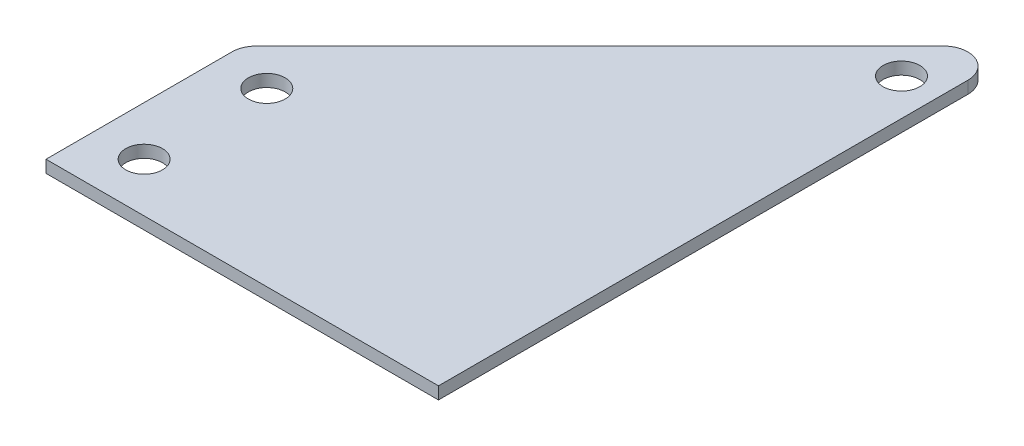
ISO-10303-21;
HEADER;
FILE_DESCRIPTION(('STEP AP214'),'2;1');
FILE_NAME('part.step','',(''),(''),'','','');
FILE_SCHEMA(('AUTOMOTIVE_DESIGN { 1 0 10303 214 1 1 1 1 }'));
ENDSEC;
DATA;
#1=APPLICATION_CONTEXT('core data for automotive mechanical design processes');
#2=APPLICATION_PROTOCOL_DEFINITION('international standard','automotive_design',2000,#1);
#3=PRODUCT_CONTEXT('',#1,'mechanical');
#4=PRODUCT('Part','Part','',(#3));
#5=PRODUCT_RELATED_PRODUCT_CATEGORY('part','',(#4));
#6=PRODUCT_DEFINITION_FORMATION('','',#4);
#7=PRODUCT_DEFINITION_CONTEXT('part definition',#1,'design');
#8=PRODUCT_DEFINITION('design','',#6,#7);
#9=PRODUCT_DEFINITION_SHAPE('','',#8);
#10=(LENGTH_UNIT() NAMED_UNIT(*) SI_UNIT(.MILLI.,.METRE.));
#11=(NAMED_UNIT(*) PLANE_ANGLE_UNIT() SI_UNIT($,.RADIAN.));
#12=(NAMED_UNIT(*) SI_UNIT($,.STERADIAN.) SOLID_ANGLE_UNIT());
#13=UNCERTAINTY_MEASURE_WITH_UNIT(LENGTH_MEASURE(1.E-05),#10,'distance_accuracy_value','');
#14=(GEOMETRIC_REPRESENTATION_CONTEXT(3) GLOBAL_UNCERTAINTY_ASSIGNED_CONTEXT((#13)) GLOBAL_UNIT_ASSIGNED_CONTEXT((#10,
#11,#12)) REPRESENTATION_CONTEXT('',''));
#15=CARTESIAN_POINT('',(0.,0.,0.));
#16=DIRECTION('',(0.,0.,1.));
#17=DIRECTION('',(1.,0.,0.));
#18=AXIS2_PLACEMENT_3D('',#15,#16,#17);
#19=CARTESIAN_POINT('',(-190.5,6.35,-96.266));
#20=DIRECTION('',(0.,1.,0.));
#21=DIRECTION('',(0.,0.,1.));
#22=AXIS2_PLACEMENT_3D('',#19,#20,#21);
#23=PLANE('',#22);
#24=CARTESIAN_POINT('',(-177.8,6.35,-88.9));
#25=DIRECTION('',(0.,1.,0.));
#26=DIRECTION('',(0.,0.,1.));
#27=AXIS2_PLACEMENT_3D('',#24,#25,#26);
#28=CIRCLE('',#27,9.525);
#29=CARTESIAN_POINT('',(-177.8,6.35,-79.375));
#30=VERTEX_POINT('',#29);
#31=EDGE_CURVE('E183',#30,#30,#28,.T.);
#32=ORIENTED_EDGE('',*,*,#31,.F.);
#33=EDGE_LOOP('',(#32));
#34=FACE_BOUND('',#33,.T.);
#35=CARTESIAN_POINT('',(-190.5,6.35,-96.266));
#36=DIRECTION('',(0.,1.,0.));
#37=DIRECTION('',(0.,0.,1.));
#38=AXIS2_PLACEMENT_3D('',#35,#36,#37);
#39=CIRCLE('',#38,12.7);
#40=CARTESIAN_POINT('',(-199.480256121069,6.35,-105.246256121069));
#41=VERTEX_POINT('',#40);
#42=CARTESIAN_POINT('',(-203.2,6.35,-96.266));
#43=VERTEX_POINT('',#42);
#44=EDGE_CURVE('E128',#41,#43,#39,.T.);
#45=ORIENTED_EDGE('',*,*,#44,.T.);
#46=DIRECTION('',(0.,0.,1.));
#47=VECTOR('',#46,1.);
#48=CARTESIAN_POINT('',(-203.2,6.35,-96.266));
#49=LINE('',#48,#47);
#50=CARTESIAN_POINT('',(-203.2,6.35,0.));
#51=VERTEX_POINT('',#50);
#52=EDGE_CURVE('E86',#43,#51,#49,.T.);
#53=ORIENTED_EDGE('',*,*,#52,.T.);
#54=DIRECTION('',(1.,0.,0.));
#55=VECTOR('',#54,1.);
#56=CARTESIAN_POINT('',(-203.2,6.35,0.));
#57=LINE('',#56,#55);
#58=CARTESIAN_POINT('',(0.,6.35,0.));
#59=VERTEX_POINT('',#58);
#60=EDGE_CURVE('E99',#51,#59,#57,.T.);
#61=ORIENTED_EDGE('',*,*,#60,.T.);
#62=DIRECTION('',(0.,0.,-1.));
#63=VECTOR('',#62,1.);
#64=CARTESIAN_POINT('',(0.,6.35,0.));
#65=LINE('',#64,#63);
#66=CARTESIAN_POINT('',(0.,6.35,-274.066));
#67=VERTEX_POINT('',#66);
#68=EDGE_CURVE('E93',#59,#67,#65,.T.);
#69=ORIENTED_EDGE('',*,*,#68,.T.);
#70=CARTESIAN_POINT('',(-12.7,6.35,-274.066));
#71=DIRECTION('',(0.,1.,0.));
#72=DIRECTION('',(0.,0.,1.));
#73=AXIS2_PLACEMENT_3D('',#70,#71,#72);
#74=CIRCLE('',#73,12.7);
#75=CARTESIAN_POINT('',(-21.6802561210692,6.35,-283.046256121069));
#76=VERTEX_POINT('',#75);
#77=EDGE_CURVE('E97',#67,#76,#74,.T.);
#78=ORIENTED_EDGE('',*,*,#77,.T.);
#79=DIRECTION('',(-0.707106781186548,0.,0.707106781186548));
#80=VECTOR('',#79,1.);
#81=CARTESIAN_POINT('',(-21.6802561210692,6.35,-283.046256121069));
#82=LINE('',#81,#80);
#83=EDGE_CURVE('E49',#76,#41,#82,.T.);
#84=ORIENTED_EDGE('',*,*,#83,.T.);
#85=EDGE_LOOP('',(#45,#53,#61,#69,#78,#84));
#86=FACE_BOUND('',#85,.T.);
#87=CARTESIAN_POINT('',(-177.8,6.35,-25.4));
#88=DIRECTION('',(0.,1.,0.));
#89=DIRECTION('',(0.,0.,1.));
#90=AXIS2_PLACEMENT_3D('',#87,#88,#89);
#91=CIRCLE('',#90,9.525);
#92=CARTESIAN_POINT('',(-177.8,6.35,-15.875));
#93=VERTEX_POINT('',#92);
#94=EDGE_CURVE('E121',#93,#93,#91,.T.);
#95=ORIENTED_EDGE('',*,*,#94,.F.);
#96=EDGE_LOOP('',(#95));
#97=FACE_BOUND('',#96,.T.);
#98=CARTESIAN_POINT('',(-19.05,6.35,-258.735743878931));
#99=DIRECTION('',(0.,1.,0.));
#100=DIRECTION('',(0.,0.,1.));
#101=AXIS2_PLACEMENT_3D('',#98,#99,#100);
#102=CIRCLE('',#101,9.52499999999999);
#103=CARTESIAN_POINT('',(-19.05,6.35,-249.210743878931));
#104=VERTEX_POINT('',#103);
#105=EDGE_CURVE('E174',#104,#104,#102,.T.);
#106=ORIENTED_EDGE('',*,*,#105,.F.);
#107=EDGE_LOOP('',(#106));
#108=FACE_BOUND('',#107,.T.);
#109=ADVANCED_FACE('F32',(#34,#86,#97,#108),#23,.T.);
#110=CARTESIAN_POINT('',(-190.5,0.,-96.266));
#111=DIRECTION('',(0.,1.,0.));
#112=DIRECTION('',(0.,0.,1.));
#113=AXIS2_PLACEMENT_3D('',#110,#111,#112);
#114=PLANE('',#113);
#115=CARTESIAN_POINT('',(-190.5,0.,-96.266));
#116=DIRECTION('',(0.,1.,0.));
#117=DIRECTION('',(0.,0.,1.));
#118=AXIS2_PLACEMENT_3D('',#115,#116,#117);
#119=CIRCLE('',#118,12.7);
#120=CARTESIAN_POINT('',(-199.480256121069,0.,-105.246256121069));
#121=VERTEX_POINT('',#120);
#122=CARTESIAN_POINT('',(-203.2,0.,-96.266));
#123=VERTEX_POINT('',#122);
#124=EDGE_CURVE('E117',#121,#123,#119,.T.);
#125=ORIENTED_EDGE('',*,*,#124,.F.);
#126=DIRECTION('',(-0.707106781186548,0.,0.707106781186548));
#127=VECTOR('',#126,1.);
#128=CARTESIAN_POINT('',(-21.6802561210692,0.,-283.046256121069));
#129=LINE('',#128,#127);
#130=CARTESIAN_POINT('',(-21.6802561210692,0.,-283.046256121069));
#131=VERTEX_POINT('',#130);
#132=EDGE_CURVE('E78',#131,#121,#129,.T.);
#133=ORIENTED_EDGE('',*,*,#132,.F.);
#134=CARTESIAN_POINT('',(-12.7,0.,-274.066));
#135=DIRECTION('',(0.,1.,0.));
#136=DIRECTION('',(0.,0.,1.));
#137=AXIS2_PLACEMENT_3D('',#134,#135,#136);
#138=CIRCLE('',#137,12.7);
#139=CARTESIAN_POINT('',(0.,0.,-274.066));
#140=VERTEX_POINT('',#139);
#141=EDGE_CURVE('E72',#140,#131,#138,.T.);
#142=ORIENTED_EDGE('',*,*,#141,.F.);
#143=DIRECTION('',(0.,0.,-1.));
#144=VECTOR('',#143,1.);
#145=CARTESIAN_POINT('',(0.,0.,0.));
#146=LINE('',#145,#144);
#147=CARTESIAN_POINT('',(0.,0.,0.));
#148=VERTEX_POINT('',#147);
#149=EDGE_CURVE('E107',#148,#140,#146,.T.);
#150=ORIENTED_EDGE('',*,*,#149,.F.);
#151=DIRECTION('',(1.,0.,0.));
#152=VECTOR('',#151,1.);
#153=CARTESIAN_POINT('',(-203.2,0.,0.));
#154=LINE('',#153,#152);
#155=CARTESIAN_POINT('',(-203.2,0.,0.));
#156=VERTEX_POINT('',#155);
#157=EDGE_CURVE('E123',#156,#148,#154,.T.);
#158=ORIENTED_EDGE('',*,*,#157,.F.);
#159=DIRECTION('',(0.,0.,1.));
#160=VECTOR('',#159,1.);
#161=CARTESIAN_POINT('',(-203.2,0.,-96.266));
#162=LINE('',#161,#160);
#163=EDGE_CURVE('E120',#123,#156,#162,.T.);
#164=ORIENTED_EDGE('',*,*,#163,.F.);
#165=EDGE_LOOP('',(#125,#133,#142,#150,#158,#164));
#166=FACE_BOUND('',#165,.T.);
#167=CARTESIAN_POINT('',(-177.8,0.,-25.4));
#168=DIRECTION('',(0.,1.,0.));
#169=DIRECTION('',(0.,0.,1.));
#170=AXIS2_PLACEMENT_3D('',#167,#168,#169);
#171=CIRCLE('',#170,9.525);
#172=CARTESIAN_POINT('',(-177.8,0.,-15.875));
#173=VERTEX_POINT('',#172);
#174=EDGE_CURVE('E186',#173,#173,#171,.T.);
#175=ORIENTED_EDGE('',*,*,#174,.T.);
#176=EDGE_LOOP('',(#175));
#177=FACE_BOUND('',#176,.T.);
#178=CARTESIAN_POINT('',(-177.8,0.,-88.9));
#179=DIRECTION('',(0.,1.,0.));
#180=DIRECTION('',(0.,0.,1.));
#181=AXIS2_PLACEMENT_3D('',#178,#179,#180);
#182=CIRCLE('',#181,9.525);
#183=CARTESIAN_POINT('',(-177.8,0.,-79.375));
#184=VERTEX_POINT('',#183);
#185=EDGE_CURVE('E180',#184,#184,#182,.T.);
#186=ORIENTED_EDGE('',*,*,#185,.T.);
#187=EDGE_LOOP('',(#186));
#188=FACE_BOUND('',#187,.T.);
#189=CARTESIAN_POINT('',(-19.05,0.,-258.735743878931));
#190=DIRECTION('',(0.,1.,0.));
#191=DIRECTION('',(0.,0.,1.));
#192=AXIS2_PLACEMENT_3D('',#189,#190,#191);
#193=CIRCLE('',#192,9.52499999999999);
#194=CARTESIAN_POINT('',(-19.05,0.,-249.210743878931));
#195=VERTEX_POINT('',#194);
#196=EDGE_CURVE('E177',#195,#195,#193,.T.);
#197=ORIENTED_EDGE('',*,*,#196,.T.);
#198=EDGE_LOOP('',(#197));
#199=FACE_BOUND('',#198,.T.);
#200=ADVANCED_FACE('F137',(#166,#177,#188,#199),#114,.F.);
#201=CARTESIAN_POINT('',(-190.5,6.35,-96.266));
#202=DIRECTION('',(0.,-1.,0.));
#203=DIRECTION('',(0.,0.,-1.));
#204=AXIS2_PLACEMENT_3D('',#201,#202,#203);
#205=CYLINDRICAL_SURFACE('',#204,12.7);
#206=ORIENTED_EDGE('',*,*,#124,.T.);
#207=DIRECTION('',(0.,-1.,0.));
#208=VECTOR('',#207,1.);
#209=CARTESIAN_POINT('',(-203.2,6.35,-96.266));
#210=LINE('',#209,#208);
#211=EDGE_CURVE('E11',#43,#123,#210,.T.);
#212=ORIENTED_EDGE('',*,*,#211,.F.);
#213=ORIENTED_EDGE('',*,*,#44,.F.);
#214=DIRECTION('',(0.,-1.,0.));
#215=VECTOR('',#214,1.);
#216=CARTESIAN_POINT('',(-199.480256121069,6.35,-105.246256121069));
#217=LINE('',#216,#215);
#218=EDGE_CURVE('E113',#41,#121,#217,.T.);
#219=ORIENTED_EDGE('',*,*,#218,.T.);
#220=EDGE_LOOP('',(#206,#212,#213,#219));
#221=FACE_BOUND('',#220,.T.);
#222=ADVANCED_FACE('F34',(#221),#205,.T.);
#223=CARTESIAN_POINT('',(-203.2,6.35,-96.266));
#224=DIRECTION('',(1.,0.,0.));
#225=DIRECTION('',(0.,0.,-1.));
#226=AXIS2_PLACEMENT_3D('',#223,#224,#225);
#227=PLANE('',#226);
#228=ORIENTED_EDGE('',*,*,#163,.T.);
#229=DIRECTION('',(0.,-1.,0.));
#230=VECTOR('',#229,1.);
#231=CARTESIAN_POINT('',(-203.2,6.35,0.));
#232=LINE('',#231,#230);
#233=EDGE_CURVE('E41',#51,#156,#232,.T.);
#234=ORIENTED_EDGE('',*,*,#233,.F.);
#235=ORIENTED_EDGE('',*,*,#52,.F.);
#236=ORIENTED_EDGE('',*,*,#211,.T.);
#237=EDGE_LOOP('',(#228,#234,#235,#236));
#238=FACE_BOUND('',#237,.T.);
#239=ADVANCED_FACE('F236',(#238),#227,.F.);
#240=CARTESIAN_POINT('',(-203.2,6.35,0.));
#241=DIRECTION('',(0.,0.,-1.));
#242=DIRECTION('',(-1.,0.,0.));
#243=AXIS2_PLACEMENT_3D('',#240,#241,#242);
#244=PLANE('',#243);
#245=ORIENTED_EDGE('',*,*,#157,.T.);
#246=DIRECTION('',(0.,-1.,0.));
#247=VECTOR('',#246,1.);
#248=CARTESIAN_POINT('',(0.,6.35,0.));
#249=LINE('',#248,#247);
#250=EDGE_CURVE('E108',#59,#148,#249,.T.);
#251=ORIENTED_EDGE('',*,*,#250,.F.);
#252=ORIENTED_EDGE('',*,*,#60,.F.);
#253=ORIENTED_EDGE('',*,*,#233,.T.);
#254=EDGE_LOOP('',(#245,#251,#252,#253));
#255=FACE_BOUND('',#254,.T.);
#256=ADVANCED_FACE('F134',(#255),#244,.F.);
#257=CARTESIAN_POINT('',(0.,6.35,0.));
#258=DIRECTION('',(-1.,0.,0.));
#259=DIRECTION('',(0.,0.,1.));
#260=AXIS2_PLACEMENT_3D('',#257,#258,#259);
#261=PLANE('',#260);
#262=ORIENTED_EDGE('',*,*,#149,.T.);
#263=DIRECTION('',(0.,-1.,0.));
#264=VECTOR('',#263,1.);
#265=CARTESIAN_POINT('',(0.,6.35,-274.066));
#266=LINE('',#265,#264);
#267=EDGE_CURVE('E104',#67,#140,#266,.T.);
#268=ORIENTED_EDGE('',*,*,#267,.F.);
#269=ORIENTED_EDGE('',*,*,#68,.F.);
#270=ORIENTED_EDGE('',*,*,#250,.T.);
#271=EDGE_LOOP('',(#262,#268,#269,#270));
#272=FACE_BOUND('',#271,.T.);
#273=ADVANCED_FACE('F105',(#272),#261,.F.);
#274=CARTESIAN_POINT('',(-12.7,6.35,-274.066));
#275=DIRECTION('',(0.,-1.,0.));
#276=DIRECTION('',(0.,0.,-1.));
#277=AXIS2_PLACEMENT_3D('',#274,#275,#276);
#278=CYLINDRICAL_SURFACE('',#277,12.7);
#279=ORIENTED_EDGE('',*,*,#141,.T.);
#280=DIRECTION('',(0.,-1.,0.));
#281=VECTOR('',#280,1.);
#282=CARTESIAN_POINT('',(-21.6802561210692,6.35,-283.046256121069));
#283=LINE('',#282,#281);
#284=EDGE_CURVE('E109',#76,#131,#283,.T.);
#285=ORIENTED_EDGE('',*,*,#284,.F.);
#286=ORIENTED_EDGE('',*,*,#77,.F.);
#287=ORIENTED_EDGE('',*,*,#267,.T.);
#288=EDGE_LOOP('',(#279,#285,#286,#287));
#289=FACE_BOUND('',#288,.T.);
#290=ADVANCED_FACE('F111',(#289),#278,.T.);
#291=CARTESIAN_POINT('',(-21.6802561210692,6.35,-283.046256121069));
#292=DIRECTION('',(0.707106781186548,0.,0.707106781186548));
#293=DIRECTION('',(0.707106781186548,0.,-0.707106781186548));
#294=AXIS2_PLACEMENT_3D('',#291,#292,#293);
#295=PLANE('',#294);
#296=ORIENTED_EDGE('',*,*,#132,.T.);
#297=ORIENTED_EDGE('',*,*,#218,.F.);
#298=ORIENTED_EDGE('',*,*,#83,.F.);
#299=ORIENTED_EDGE('',*,*,#284,.T.);
#300=EDGE_LOOP('',(#296,#297,#298,#299));
#301=FACE_BOUND('',#300,.T.);
#302=ADVANCED_FACE('F142',(#301),#295,.F.);
#303=CARTESIAN_POINT('',(-177.8,6.35,-25.4));
#304=DIRECTION('',(0.,-1.,0.));
#305=DIRECTION('',(0.,0.,-1.));
#306=AXIS2_PLACEMENT_3D('',#303,#304,#305);
#307=CYLINDRICAL_SURFACE('',#306,9.525);
#308=ORIENTED_EDGE('',*,*,#94,.T.);
#309=EDGE_LOOP('',(#308));
#310=FACE_BOUND('',#309,.T.);
#311=ORIENTED_EDGE('',*,*,#174,.F.);
#312=EDGE_LOOP('',(#311));
#313=FACE_BOUND('',#312,.T.);
#314=ADVANCED_FACE('F144',(#310,#313),#307,.F.);
#315=CARTESIAN_POINT('',(-177.8,6.35,-88.9));
#316=DIRECTION('',(0.,-1.,0.));
#317=DIRECTION('',(0.,0.,-1.));
#318=AXIS2_PLACEMENT_3D('',#315,#316,#317);
#319=CYLINDRICAL_SURFACE('',#318,9.525);
#320=ORIENTED_EDGE('',*,*,#31,.T.);
#321=EDGE_LOOP('',(#320));
#322=FACE_BOUND('',#321,.T.);
#323=ORIENTED_EDGE('',*,*,#185,.F.);
#324=EDGE_LOOP('',(#323));
#325=FACE_BOUND('',#324,.T.);
#326=ADVANCED_FACE('F150',(#322,#325),#319,.F.);
#327=CARTESIAN_POINT('',(-19.05,6.35,-258.735743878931));
#328=DIRECTION('',(0.,-1.,0.));
#329=DIRECTION('',(0.,0.,-1.));
#330=AXIS2_PLACEMENT_3D('',#327,#328,#329);
#331=CYLINDRICAL_SURFACE('',#330,9.52499999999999);
#332=ORIENTED_EDGE('',*,*,#105,.T.);
#333=EDGE_LOOP('',(#332));
#334=FACE_BOUND('',#333,.T.);
#335=ORIENTED_EDGE('',*,*,#196,.F.);
#336=EDGE_LOOP('',(#335));
#337=FACE_BOUND('',#336,.T.);
#338=ADVANCED_FACE('F165',(#334,#337),#331,.F.);
#339=CLOSED_SHELL('',(#109,#200,#222,#239,#256,#273,#290,#302,#314,#326,#338));
#340=MANIFOLD_SOLID_BREP('B2',#339);
#341=ADVANCED_BREP_SHAPE_REPRESENTATION('',(#18,#340),#14);
#342=SHAPE_DEFINITION_REPRESENTATION(#9,#341);
ENDSEC;
END-ISO-10303-21;
